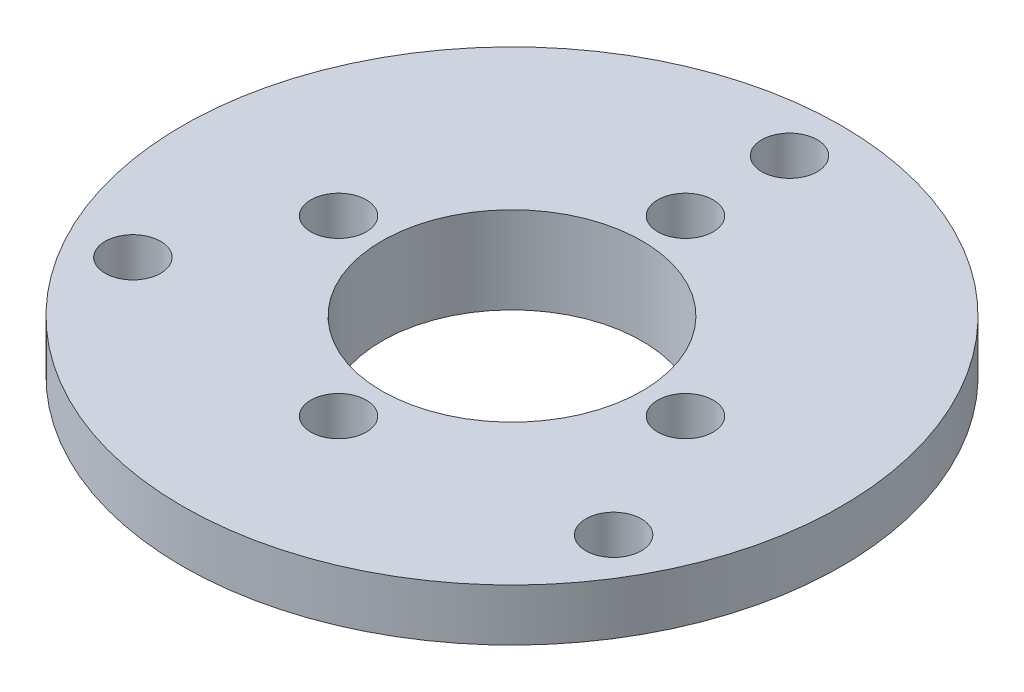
ISO-10303-21;
HEADER;
FILE_DESCRIPTION(('STEP AP214'),'2;1');
FILE_NAME('part.step','',(''),(''),'','','');
FILE_SCHEMA(('AUTOMOTIVE_DESIGN { 1 0 10303 214 1 1 1 1 }'));
ENDSEC;
DATA;
#1=APPLICATION_CONTEXT('core data for automotive mechanical design processes');
#2=APPLICATION_PROTOCOL_DEFINITION('international standard','automotive_design',2000,#1);
#3=PRODUCT_CONTEXT('',#1,'mechanical');
#4=PRODUCT('Part','Part','',(#3));
#5=PRODUCT_RELATED_PRODUCT_CATEGORY('part','',(#4));
#6=PRODUCT_DEFINITION_FORMATION('','',#4);
#7=PRODUCT_DEFINITION_CONTEXT('part definition',#1,'design');
#8=PRODUCT_DEFINITION('design','',#6,#7);
#9=PRODUCT_DEFINITION_SHAPE('','',#8);
#10=(LENGTH_UNIT() NAMED_UNIT(*) SI_UNIT(.MILLI.,.METRE.));
#11=(NAMED_UNIT(*) PLANE_ANGLE_UNIT() SI_UNIT($,.RADIAN.));
#12=(NAMED_UNIT(*) SI_UNIT($,.STERADIAN.) SOLID_ANGLE_UNIT());
#13=UNCERTAINTY_MEASURE_WITH_UNIT(LENGTH_MEASURE(1.E-05),#10,'distance_accuracy_value','');
#14=(GEOMETRIC_REPRESENTATION_CONTEXT(3) GLOBAL_UNCERTAINTY_ASSIGNED_CONTEXT((#13)) GLOBAL_UNIT_ASSIGNED_CONTEXT((#10,
#11,#12)) REPRESENTATION_CONTEXT('',''));
#15=CARTESIAN_POINT('',(0.,0.,0.));
#16=DIRECTION('',(0.,0.,1.));
#17=DIRECTION('',(1.,0.,0.));
#18=AXIS2_PLACEMENT_3D('',#15,#16,#17);
#19=CARTESIAN_POINT('',(0.,-14.2261697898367,7.5));
#20=DIRECTION('',(0.,-1.,0.));
#21=DIRECTION('',(0.,0.,-1.));
#22=AXIS2_PLACEMENT_3D('',#19,#20,#21);
#23=PLANE('',#22);
#24=CARTESIAN_POINT('',(0.,-14.2261697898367,10.));
#25=DIRECTION('',(0.,-1.,0.));
#26=DIRECTION('',(0.,0.,-1.));
#27=AXIS2_PLACEMENT_3D('',#24,#25,#26);
#28=CIRCLE('',#27,1.6);
#29=CARTESIAN_POINT('',(0.,-14.2261697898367,8.4));
#30=VERTEX_POINT('',#29);
#31=EDGE_CURVE('E100',#30,#30,#28,.T.);
#32=ORIENTED_EDGE('',*,*,#31,.F.);
#33=EDGE_LOOP('',(#32));
#34=FACE_BOUND('',#33,.T.);
#35=CARTESIAN_POINT('',(-10.,-14.2261697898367,0.));
#36=DIRECTION('',(0.,-1.,0.));
#37=DIRECTION('',(0.,0.,-1.));
#38=AXIS2_PLACEMENT_3D('',#35,#36,#37);
#39=CIRCLE('',#38,1.6);
#40=CARTESIAN_POINT('',(-10.,-14.2261697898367,-1.6));
#41=VERTEX_POINT('',#40);
#42=EDGE_CURVE('E94',#41,#41,#39,.T.);
#43=ORIENTED_EDGE('',*,*,#42,.F.);
#44=EDGE_LOOP('',(#43));
#45=FACE_BOUND('',#44,.T.);
#46=CARTESIAN_POINT('',(0.,-14.2261697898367,-10.));
#47=DIRECTION('',(0.,-1.,0.));
#48=DIRECTION('',(0.,0.,-1.));
#49=AXIS2_PLACEMENT_3D('',#46,#47,#48);
#50=CIRCLE('',#49,1.6);
#51=CARTESIAN_POINT('',(0.,-14.2261697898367,-11.6));
#52=VERTEX_POINT('',#51);
#53=EDGE_CURVE('E88',#52,#52,#50,.T.);
#54=ORIENTED_EDGE('',*,*,#53,.F.);
#55=EDGE_LOOP('',(#54));
#56=FACE_BOUND('',#55,.T.);
#57=CARTESIAN_POINT('',(10.,-14.2261697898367,0.));
#58=DIRECTION('',(0.,-1.,0.));
#59=DIRECTION('',(0.,0.,-1.));
#60=AXIS2_PLACEMENT_3D('',#57,#58,#59);
#61=CIRCLE('',#60,1.6);
#62=CARTESIAN_POINT('',(10.,-14.2261697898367,-1.6));
#63=VERTEX_POINT('',#62);
#64=EDGE_CURVE('E82',#63,#63,#61,.T.);
#65=ORIENTED_EDGE('',*,*,#64,.F.);
#66=EDGE_LOOP('',(#65));
#67=FACE_BOUND('',#66,.T.);
#68=CARTESIAN_POINT('',(0.,-14.2261697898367,0.));
#69=DIRECTION('',(0.,-1.,0.));
#70=DIRECTION('',(0.,0.,-1.));
#71=AXIS2_PLACEMENT_3D('',#68,#69,#70);
#72=CIRCLE('',#71,12.8);
#73=CARTESIAN_POINT('',(0.,-14.2261697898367,-12.8));
#74=VERTEX_POINT('',#73);
#75=EDGE_CURVE('E10',#74,#74,#72,.T.);
#76=ORIENTED_EDGE('',*,*,#75,.T.);
#77=EDGE_LOOP('',(#76));
#78=FACE_BOUND('',#77,.T.);
#79=CARTESIAN_POINT('',(0.,-14.2261697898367,0.));
#80=DIRECTION('',(0.,1.,0.));
#81=DIRECTION('',(0.,0.,1.));
#82=AXIS2_PLACEMENT_3D('',#79,#80,#81);
#83=CIRCLE('',#82,7.5);
#84=CARTESIAN_POINT('',(0.,-14.2261697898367,7.5));
#85=VERTEX_POINT('',#84);
#86=EDGE_CURVE('E58',#85,#85,#83,.T.);
#87=ORIENTED_EDGE('',*,*,#86,.T.);
#88=EDGE_LOOP('',(#87));
#89=FACE_BOUND('',#88,.T.);
#90=ADVANCED_FACE('F32',(#34,#45,#56,#67,#78,#89),#23,.T.);
#91=CARTESIAN_POINT('',(0.,0.,0.));
#92=DIRECTION('',(0.,1.,0.));
#93=DIRECTION('',(0.,0.,1.));
#94=AXIS2_PLACEMENT_3D('',#91,#92,#93);
#95=CYLINDRICAL_SURFACE('',#94,13.);
#96=CARTESIAN_POINT('',(0.,-14.0261697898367,0.));
#97=DIRECTION('',(0.,-1.,0.));
#98=DIRECTION('',(0.,0.,-1.));
#99=AXIS2_PLACEMENT_3D('',#96,#97,#98);
#100=CIRCLE('',#99,13.);
#101=CARTESIAN_POINT('',(0.,-14.0261697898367,-13.));
#102=VERTEX_POINT('',#101);
#103=EDGE_CURVE('E39',#102,#102,#100,.F.);
#104=ORIENTED_EDGE('',*,*,#103,.T.);
#105=EDGE_LOOP('',(#104));
#106=FACE_BOUND('',#105,.T.);
#107=CARTESIAN_POINT('',(0.,-12.2261697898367,0.));
#108=DIRECTION('',(0.,1.,0.));
#109=DIRECTION('',(0.,0.,1.));
#110=AXIS2_PLACEMENT_3D('',#107,#108,#109);
#111=CIRCLE('',#110,13.);
#112=CARTESIAN_POINT('',(0.,-12.2261697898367,13.));
#113=VERTEX_POINT('',#112);
#114=EDGE_CURVE('E43',#113,#113,#111,.T.);
#115=ORIENTED_EDGE('',*,*,#114,.F.);
#116=EDGE_LOOP('',(#115));
#117=FACE_BOUND('',#116,.T.);
#118=ADVANCED_FACE('F109',(#106,#117),#95,.T.);
#119=CARTESIAN_POINT('',(0.,-12.2261697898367,13.));
#120=DIRECTION('',(0.,-1.,0.));
#121=DIRECTION('',(0.,0.,-1.));
#122=AXIS2_PLACEMENT_3D('',#119,#120,#121);
#123=PLANE('',#122);
#124=CARTESIAN_POINT('',(13.856406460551,-12.2261697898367,7.99999999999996));
#125=DIRECTION('',(0.,-1.,0.));
#126=DIRECTION('',(0.,0.,-1.));
#127=AXIS2_PLACEMENT_3D('',#124,#125,#126);
#128=CIRCLE('',#127,1.6);
#129=CARTESIAN_POINT('',(13.856406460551,-12.2261697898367,6.39999999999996));
#130=VERTEX_POINT('',#129);
#131=EDGE_CURVE('E73',#130,#130,#128,.T.);
#132=ORIENTED_EDGE('',*,*,#131,.F.);
#133=EDGE_LOOP('',(#132));
#134=FACE_BOUND('',#133,.T.);
#135=CARTESIAN_POINT('',(0.,-12.2261697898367,-16.));
#136=DIRECTION('',(0.,-1.,0.));
#137=DIRECTION('',(0.,0.,-1.));
#138=AXIS2_PLACEMENT_3D('',#135,#136,#137);
#139=CIRCLE('',#138,1.6);
#140=CARTESIAN_POINT('',(0.,-12.2261697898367,-17.6));
#141=VERTEX_POINT('',#140);
#142=EDGE_CURVE('E67',#141,#141,#139,.T.);
#143=ORIENTED_EDGE('',*,*,#142,.F.);
#144=EDGE_LOOP('',(#143));
#145=FACE_BOUND('',#144,.T.);
#146=CARTESIAN_POINT('',(-13.856406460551,-12.2261697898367,7.99999999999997));
#147=DIRECTION('',(0.,-1.,0.));
#148=DIRECTION('',(0.,0.,-1.));
#149=AXIS2_PLACEMENT_3D('',#146,#147,#148);
#150=CIRCLE('',#149,1.6);
#151=CARTESIAN_POINT('',(-13.856406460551,-12.2261697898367,6.39999999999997));
#152=VERTEX_POINT('',#151);
#153=EDGE_CURVE('E61',#152,#152,#150,.T.);
#154=ORIENTED_EDGE('',*,*,#153,.F.);
#155=EDGE_LOOP('',(#154));
#156=FACE_BOUND('',#155,.T.);
#157=ORIENTED_EDGE('',*,*,#114,.T.);
#158=EDGE_LOOP('',(#157));
#159=FACE_BOUND('',#158,.T.);
#160=CARTESIAN_POINT('',(0.,-12.2261697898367,0.));
#161=DIRECTION('',(0.,1.,0.));
#162=DIRECTION('',(0.,0.,1.));
#163=AXIS2_PLACEMENT_3D('',#160,#161,#162);
#164=CIRCLE('',#163,19.);
#165=CARTESIAN_POINT('',(0.,-12.2261697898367,19.));
#166=VERTEX_POINT('',#165);
#167=EDGE_CURVE('E47',#166,#166,#164,.T.);
#168=ORIENTED_EDGE('',*,*,#167,.F.);
#169=EDGE_LOOP('',(#168));
#170=FACE_BOUND('',#169,.T.);
#171=ADVANCED_FACE('F137',(#134,#145,#156,#159,#170),#123,.T.);
#172=CARTESIAN_POINT('',(0.,0.,0.));
#173=DIRECTION('',(0.,1.,0.));
#174=DIRECTION('',(0.,0.,1.));
#175=AXIS2_PLACEMENT_3D('',#172,#173,#174);
#176=CYLINDRICAL_SURFACE('',#175,19.);
#177=ORIENTED_EDGE('',*,*,#167,.T.);
#178=EDGE_LOOP('',(#177));
#179=FACE_BOUND('',#178,.T.);
#180=CARTESIAN_POINT('',(0.,-9.22616978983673,0.));
#181=DIRECTION('',(0.,1.,0.));
#182=DIRECTION('',(0.,0.,1.));
#183=AXIS2_PLACEMENT_3D('',#180,#181,#182);
#184=CIRCLE('',#183,19.);
#185=CARTESIAN_POINT('',(0.,-9.22616978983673,19.));
#186=VERTEX_POINT('',#185);
#187=EDGE_CURVE('E52',#186,#186,#184,.T.);
#188=ORIENTED_EDGE('',*,*,#187,.F.);
#189=EDGE_LOOP('',(#188));
#190=FACE_BOUND('',#189,.T.);
#191=ADVANCED_FACE('F129',(#179,#190),#176,.T.);
#192=CARTESIAN_POINT('',(0.,-9.22616978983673,7.5));
#193=DIRECTION('',(0.,1.,0.));
#194=DIRECTION('',(0.,0.,1.));
#195=AXIS2_PLACEMENT_3D('',#192,#193,#194);
#196=PLANE('',#195);
#197=CARTESIAN_POINT('',(0.,-9.22616978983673,10.));
#198=DIRECTION('',(0.,1.,0.));
#199=DIRECTION('',(0.,0.,1.));
#200=AXIS2_PLACEMENT_3D('',#197,#198,#199);
#201=CIRCLE('',#200,1.6);
#202=CARTESIAN_POINT('',(0.,-9.22616978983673,11.6));
#203=VERTEX_POINT('',#202);
#204=EDGE_CURVE('E97',#203,#203,#201,.T.);
#205=ORIENTED_EDGE('',*,*,#204,.F.);
#206=EDGE_LOOP('',(#205));
#207=FACE_BOUND('',#206,.T.);
#208=CARTESIAN_POINT('',(-10.,-9.22616978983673,0.));
#209=DIRECTION('',(0.,1.,0.));
#210=DIRECTION('',(0.,0.,1.));
#211=AXIS2_PLACEMENT_3D('',#208,#209,#210);
#212=CIRCLE('',#211,1.6);
#213=CARTESIAN_POINT('',(-10.,-9.22616978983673,1.6));
#214=VERTEX_POINT('',#213);
#215=EDGE_CURVE('E91',#214,#214,#212,.T.);
#216=ORIENTED_EDGE('',*,*,#215,.F.);
#217=EDGE_LOOP('',(#216));
#218=FACE_BOUND('',#217,.T.);
#219=CARTESIAN_POINT('',(0.,-9.22616978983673,-10.));
#220=DIRECTION('',(0.,1.,0.));
#221=DIRECTION('',(0.,0.,1.));
#222=AXIS2_PLACEMENT_3D('',#219,#220,#221);
#223=CIRCLE('',#222,1.6);
#224=CARTESIAN_POINT('',(0.,-9.22616978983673,-8.4));
#225=VERTEX_POINT('',#224);
#226=EDGE_CURVE('E85',#225,#225,#223,.T.);
#227=ORIENTED_EDGE('',*,*,#226,.F.);
#228=EDGE_LOOP('',(#227));
#229=FACE_BOUND('',#228,.T.);
#230=CARTESIAN_POINT('',(10.,-9.22616978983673,0.));
#231=DIRECTION('',(0.,1.,0.));
#232=DIRECTION('',(0.,0.,1.));
#233=AXIS2_PLACEMENT_3D('',#230,#231,#232);
#234=CIRCLE('',#233,1.6);
#235=CARTESIAN_POINT('',(10.,-9.22616978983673,1.6));
#236=VERTEX_POINT('',#235);
#237=EDGE_CURVE('E79',#236,#236,#234,.T.);
#238=ORIENTED_EDGE('',*,*,#237,.F.);
#239=EDGE_LOOP('',(#238));
#240=FACE_BOUND('',#239,.T.);
#241=CARTESIAN_POINT('',(13.856406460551,-9.22616978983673,7.99999999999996));
#242=DIRECTION('',(0.,1.,0.));
#243=DIRECTION('',(0.,0.,1.));
#244=AXIS2_PLACEMENT_3D('',#241,#242,#243);
#245=CIRCLE('',#244,1.6);
#246=CARTESIAN_POINT('',(13.856406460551,-9.22616978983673,9.59999999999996));
#247=VERTEX_POINT('',#246);
#248=EDGE_CURVE('E76',#247,#247,#245,.T.);
#249=ORIENTED_EDGE('',*,*,#248,.F.);
#250=EDGE_LOOP('',(#249));
#251=FACE_BOUND('',#250,.T.);
#252=CARTESIAN_POINT('',(0.,-9.22616978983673,-16.));
#253=DIRECTION('',(0.,1.,0.));
#254=DIRECTION('',(0.,0.,1.));
#255=AXIS2_PLACEMENT_3D('',#252,#253,#254);
#256=CIRCLE('',#255,1.6);
#257=CARTESIAN_POINT('',(0.,-9.22616978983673,-14.4));
#258=VERTEX_POINT('',#257);
#259=EDGE_CURVE('E70',#258,#258,#256,.T.);
#260=ORIENTED_EDGE('',*,*,#259,.F.);
#261=EDGE_LOOP('',(#260));
#262=FACE_BOUND('',#261,.T.);
#263=CARTESIAN_POINT('',(-13.856406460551,-9.22616978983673,7.99999999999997));
#264=DIRECTION('',(0.,1.,0.));
#265=DIRECTION('',(0.,0.,1.));
#266=AXIS2_PLACEMENT_3D('',#263,#264,#265);
#267=CIRCLE('',#266,1.6);
#268=CARTESIAN_POINT('',(-13.856406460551,-9.22616978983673,9.59999999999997));
#269=VERTEX_POINT('',#268);
#270=EDGE_CURVE('E64',#269,#269,#267,.T.);
#271=ORIENTED_EDGE('',*,*,#270,.F.);
#272=EDGE_LOOP('',(#271));
#273=FACE_BOUND('',#272,.T.);
#274=ORIENTED_EDGE('',*,*,#187,.T.);
#275=EDGE_LOOP('',(#274));
#276=FACE_BOUND('',#275,.T.);
#277=CARTESIAN_POINT('',(0.,-9.22616978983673,0.));
#278=DIRECTION('',(0.,1.,0.));
#279=DIRECTION('',(0.,0.,1.));
#280=AXIS2_PLACEMENT_3D('',#277,#278,#279);
#281=CIRCLE('',#280,7.5);
#282=CARTESIAN_POINT('',(0.,-9.22616978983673,7.5));
#283=VERTEX_POINT('',#282);
#284=EDGE_CURVE('E55',#283,#283,#281,.T.);
#285=ORIENTED_EDGE('',*,*,#284,.F.);
#286=EDGE_LOOP('',(#285));
#287=FACE_BOUND('',#286,.T.);
#288=ADVANCED_FACE('F120',(#207,#218,#229,#240,#251,#262,#273,#276,#287),#196,.T.);
#289=CARTESIAN_POINT('',(0.,0.,0.));
#290=DIRECTION('',(0.,1.,0.));
#291=DIRECTION('',(0.,0.,1.));
#292=AXIS2_PLACEMENT_3D('',#289,#290,#291);
#293=CYLINDRICAL_SURFACE('',#292,7.5);
#294=ORIENTED_EDGE('',*,*,#284,.T.);
#295=EDGE_LOOP('',(#294));
#296=FACE_BOUND('',#295,.T.);
#297=ORIENTED_EDGE('',*,*,#86,.F.);
#298=EDGE_LOOP('',(#297));
#299=FACE_BOUND('',#298,.T.);
#300=ADVANCED_FACE('F118',(#296,#299),#293,.F.);
#301=CARTESIAN_POINT('',(0.,-14.0261697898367,0.));
#302=DIRECTION('',(0.,1.,0.));
#303=DIRECTION('',(0.,0.,1.));
#304=AXIS2_PLACEMENT_3D('',#301,#302,#303);
#305=CONICAL_SURFACE('',#304,13.,0.785398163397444);
#306=ORIENTED_EDGE('',*,*,#75,.F.);
#307=EDGE_LOOP('',(#306));
#308=FACE_BOUND('',#307,.T.);
#309=ORIENTED_EDGE('',*,*,#103,.F.);
#310=EDGE_LOOP('',(#309));
#311=FACE_BOUND('',#310,.T.);
#312=ADVANCED_FACE('F34',(#308,#311),#305,.T.);
#313=CARTESIAN_POINT('',(-13.856406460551,-14.2261697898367,7.99999999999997));
#314=DIRECTION('',(0.,-1.,0.));
#315=DIRECTION('',(0.,0.,-1.));
#316=AXIS2_PLACEMENT_3D('',#313,#314,#315);
#317=CYLINDRICAL_SURFACE('',#316,1.6);
#318=ORIENTED_EDGE('',*,*,#153,.T.);
#319=EDGE_LOOP('',(#318));
#320=FACE_BOUND('',#319,.T.);
#321=ORIENTED_EDGE('',*,*,#270,.T.);
#322=EDGE_LOOP('',(#321));
#323=FACE_BOUND('',#322,.T.);
#324=ADVANCED_FACE('F127',(#320,#323),#317,.F.);
#325=CARTESIAN_POINT('',(0.,-14.2261697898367,-16.));
#326=DIRECTION('',(0.,-1.,0.));
#327=DIRECTION('',(0.,0.,-1.));
#328=AXIS2_PLACEMENT_3D('',#325,#326,#327);
#329=CYLINDRICAL_SURFACE('',#328,1.6);
#330=ORIENTED_EDGE('',*,*,#142,.T.);
#331=EDGE_LOOP('',(#330));
#332=FACE_BOUND('',#331,.T.);
#333=ORIENTED_EDGE('',*,*,#259,.T.);
#334=EDGE_LOOP('',(#333));
#335=FACE_BOUND('',#334,.T.);
#336=ADVANCED_FACE('F180',(#332,#335),#329,.F.);
#337=CARTESIAN_POINT('',(13.856406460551,-14.2261697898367,7.99999999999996));
#338=DIRECTION('',(0.,-1.,0.));
#339=DIRECTION('',(0.,0.,-1.));
#340=AXIS2_PLACEMENT_3D('',#337,#338,#339);
#341=CYLINDRICAL_SURFACE('',#340,1.6);
#342=ORIENTED_EDGE('',*,*,#131,.T.);
#343=EDGE_LOOP('',(#342));
#344=FACE_BOUND('',#343,.T.);
#345=ORIENTED_EDGE('',*,*,#248,.T.);
#346=EDGE_LOOP('',(#345));
#347=FACE_BOUND('',#346,.T.);
#348=ADVANCED_FACE('F190',(#344,#347),#341,.F.);
#349=CARTESIAN_POINT('',(10.,-14.2261697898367,0.));
#350=DIRECTION('',(0.,-1.,0.));
#351=DIRECTION('',(0.,0.,-1.));
#352=AXIS2_PLACEMENT_3D('',#349,#350,#351);
#353=CYLINDRICAL_SURFACE('',#352,1.6);
#354=ORIENTED_EDGE('',*,*,#64,.T.);
#355=EDGE_LOOP('',(#354));
#356=FACE_BOUND('',#355,.T.);
#357=ORIENTED_EDGE('',*,*,#237,.T.);
#358=EDGE_LOOP('',(#357));
#359=FACE_BOUND('',#358,.T.);
#360=ADVANCED_FACE('F199',(#356,#359),#353,.F.);
#361=CARTESIAN_POINT('',(0.,-14.2261697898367,-10.));
#362=DIRECTION('',(0.,-1.,0.));
#363=DIRECTION('',(0.,0.,-1.));
#364=AXIS2_PLACEMENT_3D('',#361,#362,#363);
#365=CYLINDRICAL_SURFACE('',#364,1.6);
#366=ORIENTED_EDGE('',*,*,#53,.T.);
#367=EDGE_LOOP('',(#366));
#368=FACE_BOUND('',#367,.T.);
#369=ORIENTED_EDGE('',*,*,#226,.T.);
#370=EDGE_LOOP('',(#369));
#371=FACE_BOUND('',#370,.T.);
#372=ADVANCED_FACE('F209',(#368,#371),#365,.F.);
#373=CARTESIAN_POINT('',(-10.,-14.2261697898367,0.));
#374=DIRECTION('',(0.,-1.,0.));
#375=DIRECTION('',(0.,0.,-1.));
#376=AXIS2_PLACEMENT_3D('',#373,#374,#375);
#377=CYLINDRICAL_SURFACE('',#376,1.6);
#378=ORIENTED_EDGE('',*,*,#42,.T.);
#379=EDGE_LOOP('',(#378));
#380=FACE_BOUND('',#379,.T.);
#381=ORIENTED_EDGE('',*,*,#215,.T.);
#382=EDGE_LOOP('',(#381));
#383=FACE_BOUND('',#382,.T.);
#384=ADVANCED_FACE('F219',(#380,#383),#377,.F.);
#385=CARTESIAN_POINT('',(0.,-14.2261697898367,10.));
#386=DIRECTION('',(0.,-1.,0.));
#387=DIRECTION('',(0.,0.,-1.));
#388=AXIS2_PLACEMENT_3D('',#385,#386,#387);
#389=CYLINDRICAL_SURFACE('',#388,1.6);
#390=ORIENTED_EDGE('',*,*,#31,.T.);
#391=EDGE_LOOP('',(#390));
#392=FACE_BOUND('',#391,.T.);
#393=ORIENTED_EDGE('',*,*,#204,.T.);
#394=EDGE_LOOP('',(#393));
#395=FACE_BOUND('',#394,.T.);
#396=ADVANCED_FACE('F104',(#392,#395),#389,.F.);
#397=CLOSED_SHELL('',(#90,#118,#171,#191,#288,#300,#312,#324,#336,#348,#360,#372,#384,#396));
#398=MANIFOLD_SOLID_BREP('B2',#397);
#399=ADVANCED_BREP_SHAPE_REPRESENTATION('',(#18,#398),#14);
#400=SHAPE_DEFINITION_REPRESENTATION(#9,#399);
ENDSEC;
END-ISO-10303-21;
